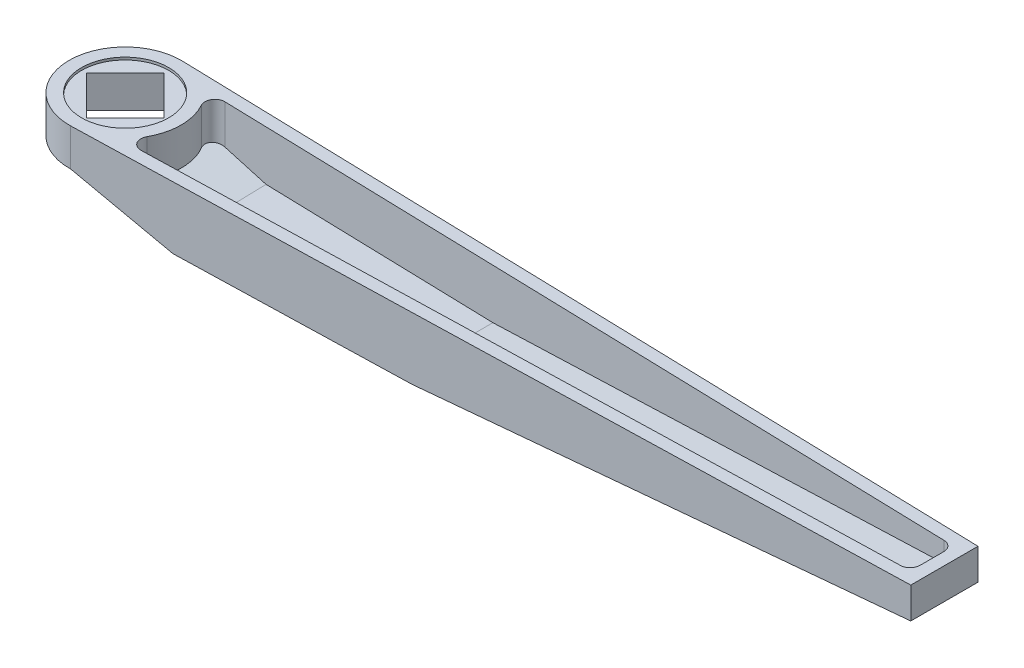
from build123d import *

# Parameters (mm, degrees)
EXTRUDE_X1_DEPTH          = 25
CUT_EXTRUDE1_DEPTH        = 333.392290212
CUT_EXTRUDE1_DEPTH_BACK   = 333.392290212
CUT_EXTRUDE_X2_DEPTH      = 331.714182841
CUT_EXTRUDE_X2_DEPTH_BACK = 331.714182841
SHELL_S1_T                = -5
SKETCH_C_R                = 22.5
EXTRUDE_X3_DEPTH          = 15
SKETCH_D_R                = 17.5
CUT_EXTRUDE_X5_DEPTH      = 1
CUT_EXTRUDE_START         = 1
SKETCH_E_R                = 17.5
CUT_EXTRUDE_X6_DEPTH      = 1
CUT_EXTRUDE_X7_DEPTH      = 331.64066598
FILLET_F1_R               = 4
SKETCH2_R                 = 17.5
CUT_EXTRUDE2_DEPTH        = 331.065523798


with BuildPart() as part:
    # Sketch A → Extrude X1 (new body)
    with BuildSketch(Plane(origin=(0, 0, 0), x_dir=(1, 0, 0), z_dir=(0, 1, 0))):
        Polygon((0.615847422, 22.491570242), (329, 13.5), (329, -13.5), (0.615847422, -22.491570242), align=None)
    extrude(amount=EXTRUDE_X1_DEPTH)

    # Sketch1 → Cut-Extrude1 (cut, two sides: drawn at the far end of the back side and taken through both)
    with BuildSketch(Plane(origin=(0.615847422, 0, 22.491570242), x_dir=(0.9996253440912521, 0, -0.02737099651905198), z_dir=(0.02737099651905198, 0, 0.9996253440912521)).offset(-CUT_EXTRUDE1_DEPTH_BACK)):
        Polygon((-649.672635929, 172.418158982), (0, 10), (40, 0), (689.672635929, -162.418158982), (364.836317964, -1461.76343084), (-974.508953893, -1126.927112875), align=None)
    extrude(amount=CUT_EXTRUDE1_DEPTH + CUT_EXTRUDE1_DEPTH_BACK, mode=Mode.SUBTRACT)

    # Sketch B → Cut-Extrude X2 (cut, two sides: drawn at the far end of the back side and taken through both)
    with BuildSketch(Plane.XY.offset(-CUT_EXTRUDE_X2_DEPTH_BACK)):
        Polygon((329, 12.5), (134, 0), (134, -74.146668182), (362.466184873, -74.146668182), (356.911911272, 12.5), align=None)
    extrude(amount=CUT_EXTRUDE_X2_DEPTH + CUT_EXTRUDE_X2_DEPTH_BACK, mode=Mode.SUBTRACT)

    # Shell S1
    shell_s1_openings = [part.faces().sort_by_distance(p)[0] for p in [
        (151.13486474, 25, 0),
        (0.615847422, 17.422787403, -0.076142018),
    ]]
    offset(amount=SHELL_S1_T, openings=shell_s1_openings, kind=Kind.INTERSECTION)

    # Sketch C → Extrude X3 (add)
    with BuildSketch(Plane(origin=(0, 25, 0), x_dir=(1, 0, 0), z_dir=(0, 1, 0))):
        Circle(SKETCH_C_R)
    extrude(amount=-EXTRUDE_X3_DEPTH)

    # Sketch D → Cut-Extrude X5 (cut)
    with BuildSketch(Plane(origin=(0, 10, 0), x_dir=(-1, 0, 0), z_dir=(0, -1, 0))):
        with Locations(Location((0, 0, 0), (0, 0, 90))):
            Circle(SKETCH_D_R)
    extrude(amount=-CUT_EXTRUDE_X5_DEPTH, mode=Mode.SUBTRACT)

    # Sketch E → Cut-Extrude X6 (cut)
    with BuildSketch(Plane.XZ.offset(-25).offset(CUT_EXTRUDE_START)):
        with Locations(Location((0, 0, 0), (0, 0, 270))):
            Circle(SKETCH_E_R)
    extrude(amount=-CUT_EXTRUDE_X6_DEPTH, mode=Mode.SUBTRACT)

    # Sketch F → Cut-Extrude X7 (cut, through all)
    with BuildSketch(Plane(origin=(0, 24, 0), x_dir=(-1, 0, 0), z_dir=(0, -1, 0))):
        Polygon((0, 15.556349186), (-15.556349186, 0), (0, -15.556349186), (15.556349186, 0), align=None)
    extrude(amount=CUT_EXTRUDE_X7_DEPTH, mode=Mode.SUBTRACT)

    # Fillet F1
    fillet_f1_edges = [part.edges().sort_by_distance(p)[0] for p in [
        (324, 21.094874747, 8.635032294),
        (324, 21.094874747, -8.635032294),
        (14.615829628, 18.192119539, -17.106359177),
        (14.615829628, 18.309174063, 17.106359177),
    ]]
    fillet(fillet_f1_edges, radius=FILLET_F1_R)

    # Sketch2 → Cut-Extrude2 (cut, through all)
    with BuildSketch(Plane.XZ.offset(-11)):
        with Locations(Location((0, 0, 0), (0, 0, 270))):
            Circle(SKETCH2_R)
    extrude(amount=CUT_EXTRUDE2_DEPTH, mode=Mode.SUBTRACT)


solid = part.part
